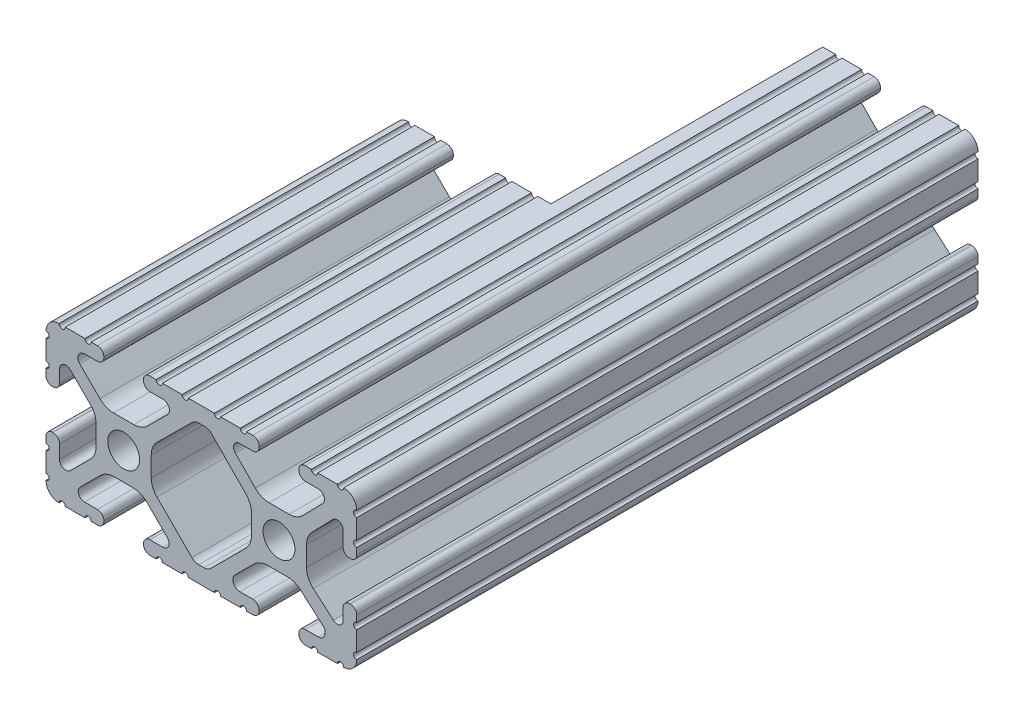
from build123d import *

# Parameters (mm, degrees)
SKETCH1_R           = 2.6035
BOSS_EXTRUDE1_DEPTH = 50.8
SKETCH2_W           = 25.4
SKETCH2_H           = 44.45
CUT_EXTRUDE1_DEPTH  = 63.217039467


with BuildPart() as part:
    # Sketch1 → Boss-Extrude1 (new, symmetric)
    with BuildSketch(Plane.XY):
        with BuildLine():
            Line((18.01710265, 12.7), (16.98745015, 12.7))
            ThreePointArc((16.98745015, 12.7), (16.245730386, 12.392769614), (15.9385, 11.65104985))
            Line((15.9385, 11.65104985), (15.9385, 11.53922))
            ThreePointArc((15.9385, 11.53922), (16.245750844, 10.797450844), (16.98752, 10.4902))
            Line((16.98752, 10.4902), (19.116384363, 10.4902))
            ThreePointArc((19.116384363, 10.4902), (20.052502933, 9.869096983), (19.844087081, 8.765172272))
            Line((19.844087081, 8.765172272), (16.618993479, 5.455112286))
            ThreePointArc((16.618993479, 5.455112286), (15.578994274, 4.745442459), (14.344932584, 4.4958))
            Line((14.344932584, 4.4958), (11.083317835, 4.4958))
            ThreePointArc((11.083317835, 4.4958), (9.854330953, 4.743306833), (8.816955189, 5.447238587))
            Line((8.816955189, 5.447238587), (5.564154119, 8.762652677))
            ThreePointArc((5.564154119, 8.762652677), (5.352591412, 9.867473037), (6.289393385, 10.4902))
            Line((6.289393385, 10.4902), (8.41248, 10.4902))
            ThreePointArc((8.41248, 10.4902), (9.154249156, 10.797450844), (9.4615, 11.53922))
            Line((9.4615, 11.53922), (9.4615, 11.65104985))
            ThreePointArc((9.4615, 11.65104985), (9.154269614, 12.392769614), (8.41254985, 12.7))
            Line((8.41254985, 12.7), (7.38288465, 12.7))
            ThreePointArc((7.38288465, 12.7), (6.87488465, 12.192), (6.36688465, 12.7))
            Line((6.36688465, 12.7), (3.14958095, 12.7))
            ThreePointArc((3.14958095, 12.7), (2.64158095, 12.192), (2.13358095, 12.7))
            Line((2.13358095, 12.7), (-2.13358095, 12.7))
            ThreePointArc((-2.13358095, 12.7), (-2.64158095, 12.192), (-3.14958095, 12.7))
            Line((-3.14958095, 12.7), (-6.36689735, 12.7))
            ThreePointArc((-6.36689735, 12.7), (-6.87489735, 12.192), (-7.38289735, 12.7))
            Line((-7.38289735, 12.7), (-8.41254985, 12.7))
            ThreePointArc((-8.41254985, 12.7), (-9.154269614, 12.392769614), (-9.4615, 11.65104985))
            Line((-9.4615, 11.65104985), (-9.4615, 11.53922))
            ThreePointArc((-9.4615, 11.53922), (-9.154249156, 10.797450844), (-8.41248, 10.4902))
            Line((-8.41248, 10.4902), (-6.283641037, 10.4902))
            ThreePointArc((-6.283641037, 10.4902), (-5.297291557, 9.829633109), (-5.532576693, 8.666071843))
            Line((-5.532576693, 8.666071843), (-8.809985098, 5.416263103))
            ThreePointArc((-8.809985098, 5.416263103), (-9.836720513, 4.734920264), (-11.045536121, 4.4958))
            Line((-11.045536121, 4.4958), (-14.354463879, 4.4958))
            ThreePointArc((-14.354463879, 4.4958), (-15.563279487, 4.734920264), (-16.590014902, 5.416263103))
            Line((-16.590014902, 5.416263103), (-19.867423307, 8.666071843))
            ThreePointArc((-19.867423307, 8.666071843), (-20.102708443, 9.829633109), (-19.116358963, 10.4902))
            Line((-19.116358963, 10.4902), (-16.98752, 10.4902))
            ThreePointArc((-16.98752, 10.4902), (-16.245750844, 10.797450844), (-15.9385, 11.53922))
            Line((-15.9385, 11.53922), (-15.9385, 11.65104985))
            ThreePointArc((-15.9385, 11.65104985), (-16.245730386, 12.392769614), (-16.98745015, 12.7))
            Line((-16.98745015, 12.7), (-18.01711535, 12.7))
            ThreePointArc((-18.01711535, 12.7), (-18.52511535, 12.192), (-19.03311535, 12.7))
            Line((-19.03311535, 12.7), (-22.2504, 12.7))
            ThreePointArc((-22.2504, 12.7), (-22.758323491, 12.192000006), (-23.266399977, 12.699846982))
            ThreePointArc((-23.266399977, 12.699846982), (-24.782522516, 12.082522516), (-25.399846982, 10.566399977))
            ThreePointArc((-25.399846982, 10.566399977), (-24.892000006, 10.058323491), (-25.4, 9.5504))
            Line((-25.4, 9.5504), (-25.4, 6.3330836))
            ThreePointArc((-25.4, 6.3330836), (-24.892, 5.8250836), (-25.4, 5.3170836))
            Line((-25.4, 5.3170836), (-25.4, 4.237520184))
            ThreePointArc((-25.4, 4.237520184), (-25.107393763, 3.531106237), (-24.400979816, 3.2385))
            Line((-24.400979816, 3.2385), (-24.23922, 3.2385))
            ThreePointArc((-24.23922, 3.2385), (-23.497450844, 3.545750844), (-23.1902, 4.28752))
            Line((-23.1902, 4.28752), (-23.1902, 6.334741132))
            ThreePointArc((-23.1902, 6.334741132), (-22.556026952, 7.286023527), (-21.434002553, 7.066535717))
            Line((-21.434002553, 7.066535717), (-18.147950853, 3.808156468))
            ThreePointArc((-18.147950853, 3.808156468), (-17.452759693, 2.774838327), (-17.208501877, 1.553619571))
            Line((-17.208501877, 1.553619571), (-17.208501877, -1.695179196))
            ThreePointArc((-17.208501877, -1.695179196), (-17.450738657, -2.911536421), (-18.140486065, -3.942289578))
            Line((-18.140486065, -3.942289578), (-21.431579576, -7.227386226))
            ThreePointArc((-21.431579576, -7.227386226), (-22.55444896, -7.449940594), (-23.1902, -6.498002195))
            Line((-23.1902, -6.498002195), (-23.1902, -4.28752))
            ThreePointArc((-23.1902, -4.28752), (-23.497450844, -3.545750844), (-24.23922, -3.2385))
            Line((-24.23922, -3.2385), (-24.35098, -3.2385))
            ThreePointArc((-24.35098, -3.2385), (-25.092749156, -3.545750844), (-25.4, -4.28752))
            Line((-25.4, -4.28752), (-25.4, -5.3171344))
            ThreePointArc((-25.4, -5.3171344), (-24.892, -5.8251344), (-25.4, -6.3331344))
            Line((-25.4, -6.3331344), (-25.4, -9.5504))
            ThreePointArc((-25.4, -9.5504), (-24.892000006, -10.058323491), (-25.399846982, -10.566399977))
            ThreePointArc((-25.399846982, -10.566399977), (-24.782522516, -12.082522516), (-23.266399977, -12.699846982))
            ThreePointArc((-23.266399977, -12.699846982), (-22.758323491, -12.192000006), (-22.2504, -12.7))
            Line((-22.2504, -12.7), (-19.03308995, -12.7))
            ThreePointArc((-19.03308995, -12.7), (-18.52508995, -12.192), (-18.01708995, -12.7))
            Line((-18.01708995, -12.7), (-16.9874692, -12.7))
            ThreePointArc((-16.9874692, -12.7), (-16.245700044, -12.392749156), (-15.9384492, -11.65098))
            Line((-15.9384492, -11.65098), (-15.9384492, -11.53922))
            ThreePointArc((-15.9384492, -11.53922), (-16.245700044, -10.797450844), (-16.9874692, -10.4902))
            Line((-16.9874692, -10.4902), (-19.116358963, -10.4902))
            ThreePointArc((-19.116358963, -10.4902), (-20.055197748, -9.862578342), (-19.834124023, -8.755124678))
            Line((-19.834124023, -8.755124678), (-16.49660751, -5.423689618))
            ThreePointArc((-16.49660751, -5.423689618), (-15.467274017, -4.736928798), (-14.253591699, -4.4958))
            Line((-14.253591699, -4.4958), (-11.146408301, -4.4958))
            ThreePointArc((-11.146408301, -4.4958), (-9.932725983, -4.736928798), (-8.90339249, -5.423689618))
            Line((-8.90339249, -5.423689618), (-5.565875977, -8.755124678))
            ThreePointArc((-5.565875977, -8.755124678), (-5.344802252, -9.862578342), (-6.283641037, -10.4902))
            Line((-6.283641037, -10.4902), (-8.4125308, -10.4902))
            ThreePointArc((-8.4125308, -10.4902), (-9.154299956, -10.797450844), (-9.4615508, -11.53922))
            Line((-9.4615508, -11.53922), (-9.4615508, -11.65098))
            ThreePointArc((-9.4615508, -11.65098), (-9.154299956, -12.392749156), (-8.4125308, -12.7))
            Line((-8.4125308, -12.7), (-7.38287195, -12.7))
            ThreePointArc((-7.38287195, -12.7), (-6.87487195, -12.192), (-6.36687195, -12.7))
            Line((-6.36687195, -12.7), (-3.14960635, -12.7))
            ThreePointArc((-3.14960635, -12.7), (-2.64160635, -12.192), (-2.13360635, -12.7))
            Line((-2.13360635, -12.7), (2.13360635, -12.7))
            ThreePointArc((2.13360635, -12.7), (2.64159365, -12.1920127), (3.14958095, -12.7))
            Line((3.14958095, -12.7), (6.36691005, -12.7))
            ThreePointArc((6.36691005, -12.7), (6.87491005, -12.192), (7.38291005, -12.7))
            Line((7.38291005, -12.7), (8.4125308, -12.7))
            ThreePointArc((8.4125308, -12.7), (9.154299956, -12.392749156), (9.4615508, -11.65098))
            Line((9.4615508, -11.65098), (9.4615508, -11.53922))
            ThreePointArc((9.4615508, -11.53922), (9.154299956, -10.797450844), (8.4125308, -10.4902))
            Line((8.4125308, -10.4902), (6.289393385, -10.4902))
            ThreePointArc((6.289393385, -10.4902), (5.231590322, -9.783049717), (5.480677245, -8.535265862))
            Line((5.480677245, -8.535265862), (8.597933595, -5.423689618))
            ThreePointArc((8.597933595, -5.423689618), (9.627267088, -4.736928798), (10.840949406, -4.4958))
            Line((10.840949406, -4.4958), (14.102564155, -4.4958))
            ThreePointArc((14.102564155, -4.4958), (15.215927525, -4.697410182), (16.187895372, -5.276636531))
            Line((16.187895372, -5.276636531), (19.868247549, -8.482246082))
            ThreePointArc((19.868247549, -8.482246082), (20.188435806, -9.746879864), (19.116384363, -10.4902))
            Line((19.116384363, -10.4902), (16.9874692, -10.4902))
            ThreePointArc((16.9874692, -10.4902), (16.245700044, -10.797450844), (15.9384492, -11.53922))
            Line((15.9384492, -11.53922), (15.9384492, -11.65098))
            ThreePointArc((15.9384492, -11.65098), (16.245700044, -12.392749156), (16.9874692, -12.7))
            Line((16.9874692, -12.7), (18.01710265, -12.7))
            ThreePointArc((18.01710265, -12.7), (18.52510265, -12.192), (19.03310265, -12.7))
            Line((19.03310265, -12.7), (22.2504, -12.7))
            ThreePointArc((22.2504, -12.7), (22.758323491, -12.192000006), (23.266399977, -12.699846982))
            ThreePointArc((23.266399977, -12.699846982), (24.782522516, -12.082522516), (25.399846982, -10.566399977))
            ThreePointArc((25.399846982, -10.566399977), (24.892000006, -10.058323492), (25.4, -9.550400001))
            Line((25.4, -9.550400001), (25.4, -6.333083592))
            ThreePointArc((25.4, -6.333083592), (24.892000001, -5.825083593), (25.4, -5.317083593))
            Line((25.4, -5.317083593), (25.4, -4.237520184))
            ThreePointArc((25.4, -4.237520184), (25.107393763, -3.531106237), (24.400979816, -3.2385))
            Line((24.400979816, -3.2385), (24.189220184, -3.2385))
            ThreePointArc((24.189220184, -3.2385), (23.482806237, -3.531106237), (23.1902, -4.237520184))
            Line((23.1902, -4.237520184), (23.1902, -6.155876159))
            ThreePointArc((23.1902, -6.155876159), (22.62232736, -7.038258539), (21.583974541, -6.886926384))
            Line((21.583974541, -6.886926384), (18.29817066, -4.024970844))
            ThreePointArc((18.29817066, -4.024970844), (17.493730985, -2.946044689), (17.208501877, -1.630807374))
            Line((17.208501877, -1.630807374), (17.208501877, 1.630807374))
            ThreePointArc((17.208501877, 1.630807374), (17.442348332, 2.82673414), (18.109440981, 3.846495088))
            Line((18.109440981, 3.846495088), (21.526346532, 7.353420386))
            ThreePointArc((21.526346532, 7.353420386), (22.585896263, 7.574939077), (23.1902, 6.676867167))
            Line((23.1902, 6.676867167), (23.1902, 4.237520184))
            ThreePointArc((23.1902, 4.237520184), (23.482806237, 3.531106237), (24.189220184, 3.2385))
            Line((24.189220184, 3.2385), (24.400979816, 3.2385))
            ThreePointArc((24.400979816, 3.2385), (25.107393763, 3.531106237), (25.4, 4.237520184))
            Line((25.4, 4.237520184), (25.4, 5.3170836))
            ThreePointArc((25.4, 5.3170836), (24.891949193, 5.825134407), (25.4, 6.333185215))
            Line((25.4, 6.333185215), (25.4, 9.550400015))
            ThreePointArc((25.4, 9.550400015), (24.892000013, 10.058323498), (25.399846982, 10.566399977))
            ThreePointArc((25.399846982, 10.566399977), (24.782522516, 12.082522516), (23.266399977, 12.699846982))
            ThreePointArc((23.266399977, 12.699846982), (22.758323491, 12.192000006), (22.2504, 12.7))
            Line((22.2504, 12.7), (19.03310265, 12.7))
            ThreePointArc((19.03310265, 12.7), (18.52510265, 12.192), (18.01710265, 12.7))
        make_face()
        with Locations((-12.7, 0)):
            Circle(SKETCH1_R, mode=Mode.SUBTRACT)
        with Locations((12.7, 0)):
            Circle(SKETCH1_R, mode=Mode.SUBTRACT)
        with BuildLine():
            Line((-7.259513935, -3.869413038), (-1.545748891, -9.572766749))
            ThreePointArc((-1.545748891, -9.572766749), (-1.035199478, -9.913400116), (-0.433213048, -10.033))
            Line((-0.433213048, -10.033), (0.433213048, -10.033))
            ThreePointArc((0.433213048, -10.033), (1.035199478, -9.913400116), (1.545748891, -9.572766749))
            Line((1.545748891, -9.572766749), (7.259513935, -3.869413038))
            ThreePointArc((7.259513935, -3.869413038), (7.949261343, -2.838659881), (8.191498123, -1.622302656))
            Line((8.191498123, -1.622302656), (8.191498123, 1.622302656))
            ThreePointArc((8.191498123, 1.622302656), (7.955573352, 2.823327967), (7.282860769, 3.845864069))
            Line((7.282860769, 3.845864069), (1.675572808, 9.561086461))
            ThreePointArc((1.675572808, 9.561086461), (1.161034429, 9.910236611), (0.551456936, 10.033))
            Line((0.551456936, 10.033), (-0.395199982, 10.033))
            ThreePointArc((-0.395199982, 10.033), (-0.994772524, 9.914396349), (-1.50403329, 9.576450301))
            Line((-1.50403329, 9.576450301), (-7.252049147, 3.876839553))
            ThreePointArc((-7.252049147, 3.876839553), (-7.947240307, 2.843521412), (-8.191498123, 1.622302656))
            Line((-8.191498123, 1.622302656), (-8.191498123, -1.622302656))
            ThreePointArc((-8.191498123, -1.622302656), (-7.949261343, -2.838659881), (-7.259513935, -3.869413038))
        make_face(mode=Mode.SUBTRACT)
    extrude(amount=BOSS_EXTRUDE1_DEPTH, both=True)

    # Sketch2 → Cut-Extrude1 (cut, through all)
    with BuildSketch(Plane(origin=(0, 12.7, 0), x_dir=(1, 0, 0), z_dir=(0, 1, 0))):
        with Locations((-12.7, 28.575)):
            Rectangle(SKETCH2_W, SKETCH2_H)
    extrude(amount=-CUT_EXTRUDE1_DEPTH, mode=Mode.SUBTRACT)


solid = part.part
